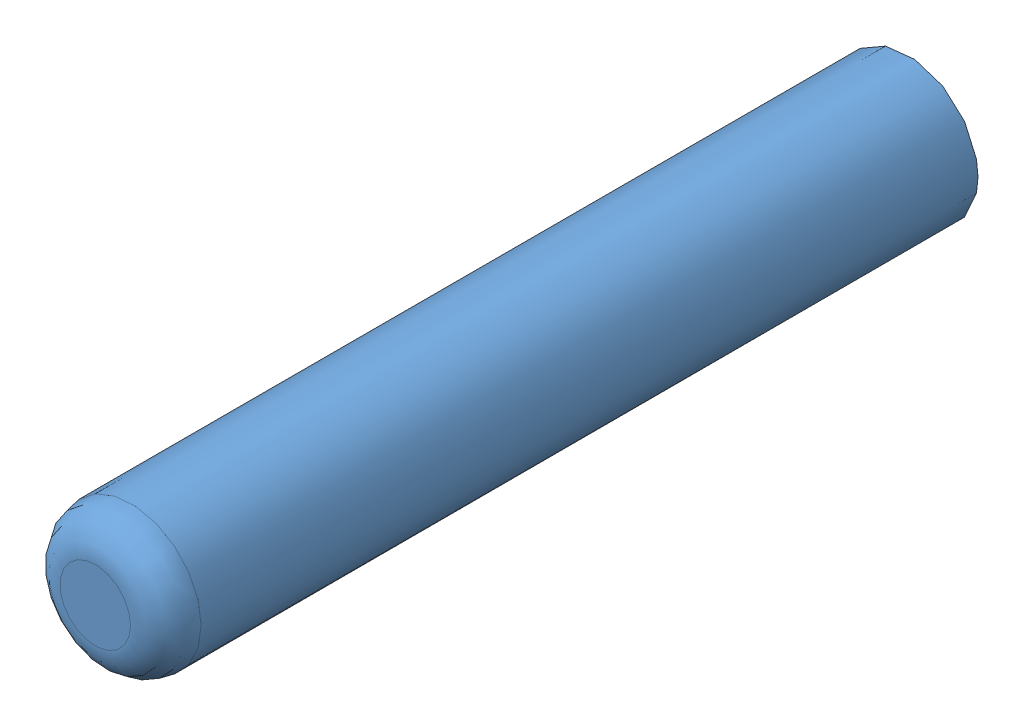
SolidWorks assembly Axe moteur roue équipé.SLDASM, configuration Défaut (file format 3100). Lengths in mm.
Overall size (7.91 7.91 11.5).
2 component instances, 2 part files, 2 mates.
Components (placement in the parent):
- Axe moteur roue-1: Axe moteur roue.SLDPRT [Défaut] at origin size (2 2 11.5)
- pignon_moteur1_12-1: pignon_moteur1_12.SLDPRT [Défaut] at (0 0 -0.75) x (0.998377 -0.056954 0) z (0 0 1) size (7.5 7.5 6)
Mates (geometry in assembly coordinates):
- Coaxiale1: concentric aligned: cylinder of Axe moteur roue-1; cylinder of pignon_moteur1_12-1
- Coïncidente1: coincident anti-aligned: circle of Axe moteur roue-1 centre (0 0 5.25) axis (0 0 -1); plane of pignon_moteur1_12-1 through (0 0 5.25) normal (0 0 1)
